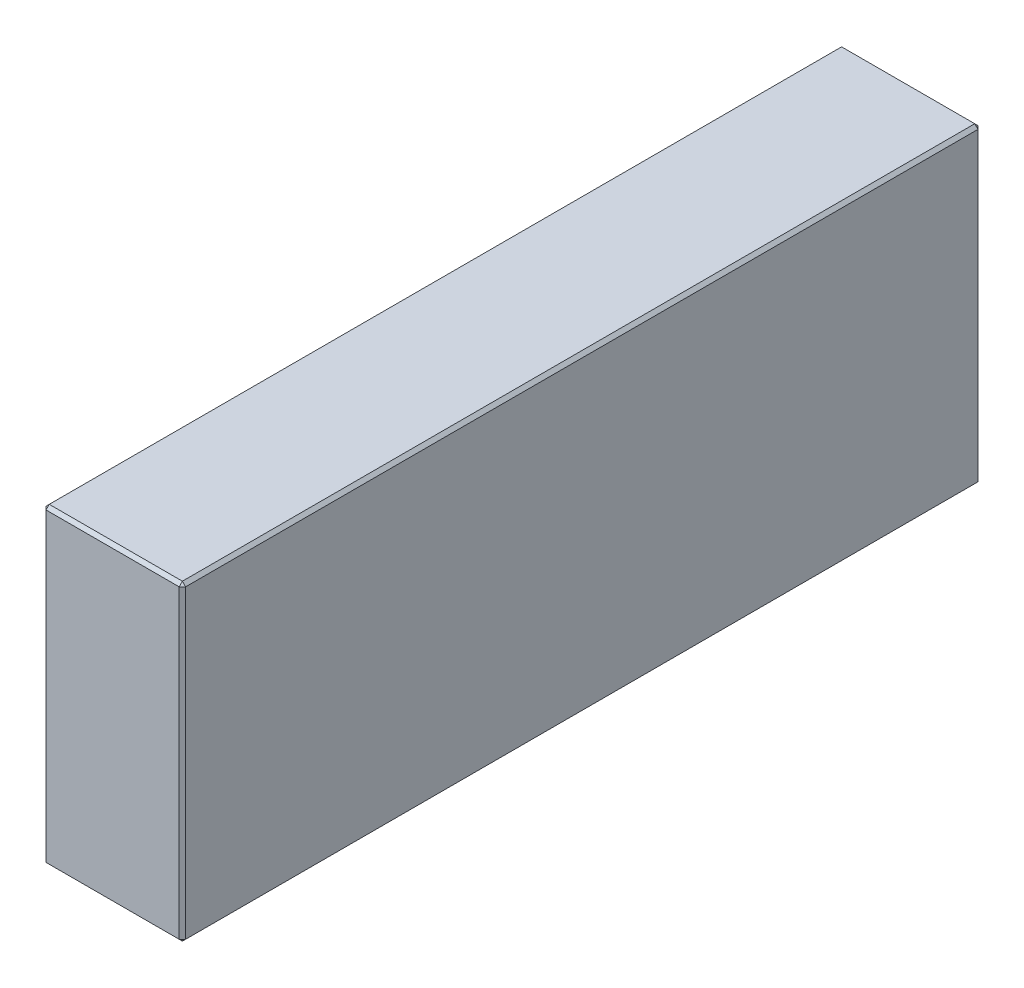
ISO-10303-21;
HEADER;
FILE_DESCRIPTION(('STEP AP214'),'2;1');
FILE_NAME('part.step','',(''),(''),'','','');
FILE_SCHEMA(('AUTOMOTIVE_DESIGN { 1 0 10303 214 1 1 1 1 }'));
ENDSEC;
DATA;
#1=APPLICATION_CONTEXT('core data for automotive mechanical design processes');
#2=APPLICATION_PROTOCOL_DEFINITION('international standard','automotive_design',2000,#1);
#3=PRODUCT_CONTEXT('',#1,'mechanical');
#4=PRODUCT('Part','Part','',(#3));
#5=PRODUCT_RELATED_PRODUCT_CATEGORY('part','',(#4));
#6=PRODUCT_DEFINITION_FORMATION('','',#4);
#7=PRODUCT_DEFINITION_CONTEXT('part definition',#1,'design');
#8=PRODUCT_DEFINITION('design','',#6,#7);
#9=PRODUCT_DEFINITION_SHAPE('','',#8);
#10=(LENGTH_UNIT() NAMED_UNIT(*) SI_UNIT(.MILLI.,.METRE.));
#11=(NAMED_UNIT(*) PLANE_ANGLE_UNIT() SI_UNIT($,.RADIAN.));
#12=(NAMED_UNIT(*) SI_UNIT($,.STERADIAN.) SOLID_ANGLE_UNIT());
#13=UNCERTAINTY_MEASURE_WITH_UNIT(LENGTH_MEASURE(1.E-05),#10,'distance_accuracy_value','');
#14=(GEOMETRIC_REPRESENTATION_CONTEXT(3) GLOBAL_UNCERTAINTY_ASSIGNED_CONTEXT((#13)) GLOBAL_UNIT_ASSIGNED_CONTEXT((#10,
#11,#12)) REPRESENTATION_CONTEXT('',''));
#15=CARTESIAN_POINT('',(0.,0.,0.));
#16=DIRECTION('',(0.,0.,1.));
#17=DIRECTION('',(1.,0.,0.));
#18=AXIS2_PLACEMENT_3D('',#15,#16,#17);
#19=CARTESIAN_POINT('',(-21.5,96.,123.));
#20=DIRECTION('',(1.,0.,0.));
#21=DIRECTION('',(0.,0.,-1.));
#22=AXIS2_PLACEMENT_3D('',#19,#20,#21);
#23=PLANE('',#22);
#24=DIRECTION('',(0.,-1.,0.));
#25=VECTOR('',#24,1.);
#26=CARTESIAN_POINT('',(-21.5,96.,-122.));
#27=LINE('',#26,#25);
#28=CARTESIAN_POINT('',(-21.5,95.,-122.));
#29=VERTEX_POINT('',#28);
#30=CARTESIAN_POINT('',(-21.5,1.,-122.));
#31=VERTEX_POINT('',#30);
#32=EDGE_CURVE('E114',#29,#31,#27,.T.);
#33=ORIENTED_EDGE('',*,*,#32,.T.);
#34=DIRECTION('',(0.,0.,1.));
#35=VECTOR('',#34,1.);
#36=CARTESIAN_POINT('',(-21.5,1.,123.));
#37=LINE('',#36,#35);
#38=CARTESIAN_POINT('',(-21.5,1.,122.));
#39=VERTEX_POINT('',#38);
#40=EDGE_CURVE('E110',#31,#39,#37,.T.);
#41=ORIENTED_EDGE('',*,*,#40,.T.);
#42=DIRECTION('',(0.,1.,0.));
#43=VECTOR('',#42,1.);
#44=CARTESIAN_POINT('',(-21.5,96.,122.));
#45=LINE('',#44,#43);
#46=CARTESIAN_POINT('',(-21.5,95.,122.));
#47=VERTEX_POINT('',#46);
#48=EDGE_CURVE('E103',#39,#47,#45,.T.);
#49=ORIENTED_EDGE('',*,*,#48,.T.);
#50=DIRECTION('',(0.,0.,-1.));
#51=VECTOR('',#50,1.);
#52=CARTESIAN_POINT('',(-21.5,95.,-123.));
#53=LINE('',#52,#51);
#54=EDGE_CURVE('E107',#47,#29,#53,.T.);
#55=ORIENTED_EDGE('',*,*,#54,.T.);
#56=EDGE_LOOP('',(#33,#41,#49,#55));
#57=FACE_BOUND('',#56,.T.);
#58=ADVANCED_FACE('F15',(#57),#23,.F.);
#59=CARTESIAN_POINT('',(21.5,96.,123.));
#60=DIRECTION('',(0.,0.,-1.));
#61=DIRECTION('',(-1.,0.,0.));
#62=AXIS2_PLACEMENT_3D('',#59,#60,#61);
#63=PLANE('',#62);
#64=DIRECTION('',(-1.,0.,0.));
#65=VECTOR('',#64,1.);
#66=CARTESIAN_POINT('',(-21.5,95.,123.));
#67=LINE('',#66,#65);
#68=CARTESIAN_POINT('',(20.5,95.,123.));
#69=VERTEX_POINT('',#68);
#70=CARTESIAN_POINT('',(-20.5,95.,123.));
#71=VERTEX_POINT('',#70);
#72=EDGE_CURVE('E164',#69,#71,#67,.T.);
#73=ORIENTED_EDGE('',*,*,#72,.T.);
#74=DIRECTION('',(0.,-1.,0.));
#75=VECTOR('',#74,1.);
#76=CARTESIAN_POINT('',(-20.5,96.,123.));
#77=LINE('',#76,#75);
#78=CARTESIAN_POINT('',(-20.5,1.,123.));
#79=VERTEX_POINT('',#78);
#80=EDGE_CURVE('E122',#71,#79,#77,.T.);
#81=ORIENTED_EDGE('',*,*,#80,.T.);
#82=DIRECTION('',(1.,0.,0.));
#83=VECTOR('',#82,1.);
#84=CARTESIAN_POINT('',(21.5,1.,123.));
#85=LINE('',#84,#83);
#86=CARTESIAN_POINT('',(20.5,1.,123.));
#87=VERTEX_POINT('',#86);
#88=EDGE_CURVE('E168',#79,#87,#85,.T.);
#89=ORIENTED_EDGE('',*,*,#88,.T.);
#90=DIRECTION('',(0.,1.,0.));
#91=VECTOR('',#90,1.);
#92=CARTESIAN_POINT('',(20.5,96.,123.));
#93=LINE('',#92,#91);
#94=EDGE_CURVE('E166',#87,#69,#93,.T.);
#95=ORIENTED_EDGE('',*,*,#94,.T.);
#96=EDGE_LOOP('',(#73,#81,#89,#95));
#97=FACE_BOUND('',#96,.T.);
#98=ADVANCED_FACE('F275',(#97),#63,.F.);
#99=CARTESIAN_POINT('',(21.5,96.,123.));
#100=DIRECTION('',(-1.,0.,0.));
#101=DIRECTION('',(0.,0.,1.));
#102=AXIS2_PLACEMENT_3D('',#99,#100,#101);
#103=PLANE('',#102);
#104=DIRECTION('',(0.,0.,-1.));
#105=VECTOR('',#104,1.);
#106=CARTESIAN_POINT('',(21.5,1.,123.));
#107=LINE('',#106,#105);
#108=CARTESIAN_POINT('',(21.5,1.,122.));
#109=VERTEX_POINT('',#108);
#110=CARTESIAN_POINT('',(21.5,1.,-122.));
#111=VERTEX_POINT('',#110);
#112=EDGE_CURVE('E159',#109,#111,#107,.T.);
#113=ORIENTED_EDGE('',*,*,#112,.T.);
#114=DIRECTION('',(0.,1.,0.));
#115=VECTOR('',#114,1.);
#116=CARTESIAN_POINT('',(21.5,96.,-122.));
#117=LINE('',#116,#115);
#118=CARTESIAN_POINT('',(21.5,95.,-122.));
#119=VERTEX_POINT('',#118);
#120=EDGE_CURVE('E161',#111,#119,#117,.T.);
#121=ORIENTED_EDGE('',*,*,#120,.T.);
#122=DIRECTION('',(0.,0.,1.));
#123=VECTOR('',#122,1.);
#124=CARTESIAN_POINT('',(21.5,95.,123.));
#125=LINE('',#124,#123);
#126=CARTESIAN_POINT('',(21.5,95.,122.));
#127=VERTEX_POINT('',#126);
#128=EDGE_CURVE('E155',#119,#127,#125,.T.);
#129=ORIENTED_EDGE('',*,*,#128,.T.);
#130=DIRECTION('',(0.,-1.,0.));
#131=VECTOR('',#130,1.);
#132=CARTESIAN_POINT('',(21.5,96.,122.));
#133=LINE('',#132,#131);
#134=EDGE_CURVE('E157',#127,#109,#133,.T.);
#135=ORIENTED_EDGE('',*,*,#134,.T.);
#136=EDGE_LOOP('',(#113,#121,#129,#135));
#137=FACE_BOUND('',#136,.T.);
#138=ADVANCED_FACE('F254',(#137),#103,.F.);
#139=CARTESIAN_POINT('',(21.5,96.,-123.));
#140=DIRECTION('',(0.,0.,1.));
#141=DIRECTION('',(1.,0.,0.));
#142=AXIS2_PLACEMENT_3D('',#139,#140,#141);
#143=PLANE('',#142);
#144=DIRECTION('',(0.,-1.,0.));
#145=VECTOR('',#144,1.);
#146=CARTESIAN_POINT('',(20.5,96.,-123.));
#147=LINE('',#146,#145);
#148=CARTESIAN_POINT('',(20.5,95.,-123.));
#149=VERTEX_POINT('',#148);
#150=CARTESIAN_POINT('',(20.5,1.,-123.));
#151=VERTEX_POINT('',#150);
#152=EDGE_CURVE('E148',#149,#151,#147,.T.);
#153=ORIENTED_EDGE('',*,*,#152,.T.);
#154=DIRECTION('',(-1.,0.,0.));
#155=VECTOR('',#154,1.);
#156=CARTESIAN_POINT('',(21.5,1.,-123.));
#157=LINE('',#156,#155);
#158=CARTESIAN_POINT('',(-20.5,1.,-123.));
#159=VERTEX_POINT('',#158);
#160=EDGE_CURVE('E153',#151,#159,#157,.T.);
#161=ORIENTED_EDGE('',*,*,#160,.T.);
#162=DIRECTION('',(0.,1.,0.));
#163=VECTOR('',#162,1.);
#164=CARTESIAN_POINT('',(-20.5,96.,-123.));
#165=LINE('',#164,#163);
#166=CARTESIAN_POINT('',(-20.5,95.,-123.));
#167=VERTEX_POINT('',#166);
#168=EDGE_CURVE('E150',#159,#167,#165,.T.);
#169=ORIENTED_EDGE('',*,*,#168,.T.);
#170=DIRECTION('',(1.,0.,0.));
#171=VECTOR('',#170,1.);
#172=CARTESIAN_POINT('',(21.5,95.,-123.));
#173=LINE('',#172,#171);
#174=EDGE_CURVE('E146',#167,#149,#173,.T.);
#175=ORIENTED_EDGE('',*,*,#174,.T.);
#176=EDGE_LOOP('',(#153,#161,#169,#175));
#177=FACE_BOUND('',#176,.T.);
#178=ADVANCED_FACE('F284',(#177),#143,.F.);
#179=CARTESIAN_POINT('',(0.,96.,0.));
#180=DIRECTION('',(0.,1.,0.));
#181=DIRECTION('',(0.,0.,1.));
#182=AXIS2_PLACEMENT_3D('',#179,#180,#181);
#183=PLANE('',#182);
#184=DIRECTION('',(0.,0.,-1.));
#185=VECTOR('',#184,1.);
#186=CARTESIAN_POINT('',(20.5,96.,-123.));
#187=LINE('',#186,#185);
#188=CARTESIAN_POINT('',(20.5,96.,122.));
#189=VERTEX_POINT('',#188);
#190=CARTESIAN_POINT('',(20.5,96.,-122.));
#191=VERTEX_POINT('',#190);
#192=EDGE_CURVE('E24',#189,#191,#187,.T.);
#193=ORIENTED_EDGE('',*,*,#192,.T.);
#194=DIRECTION('',(-1.,0.,0.));
#195=VECTOR('',#194,1.);
#196=CARTESIAN_POINT('',(-21.5,96.,-122.));
#197=LINE('',#196,#195);
#198=CARTESIAN_POINT('',(-20.5,96.,-122.));
#199=VERTEX_POINT('',#198);
#200=EDGE_CURVE('E9',#191,#199,#197,.T.);
#201=ORIENTED_EDGE('',*,*,#200,.T.);
#202=DIRECTION('',(0.,0.,1.));
#203=VECTOR('',#202,1.);
#204=CARTESIAN_POINT('',(-20.5,96.,123.));
#205=LINE('',#204,#203);
#206=CARTESIAN_POINT('',(-20.5,96.,122.));
#207=VERTEX_POINT('',#206);
#208=EDGE_CURVE('E180',#199,#207,#205,.T.);
#209=ORIENTED_EDGE('',*,*,#208,.T.);
#210=DIRECTION('',(1.,0.,0.));
#211=VECTOR('',#210,1.);
#212=CARTESIAN_POINT('',(21.5,96.,122.));
#213=LINE('',#212,#211);
#214=EDGE_CURVE('E35',#207,#189,#213,.T.);
#215=ORIENTED_EDGE('',*,*,#214,.T.);
#216=EDGE_LOOP('',(#193,#201,#209,#215));
#217=FACE_BOUND('',#216,.T.);
#218=ADVANCED_FACE('F350',(#217),#183,.T.);
#219=CARTESIAN_POINT('',(0.,0.,0.));
#220=DIRECTION('',(0.,1.,0.));
#221=DIRECTION('',(0.,0.,1.));
#222=AXIS2_PLACEMENT_3D('',#219,#220,#221);
#223=PLANE('',#222);
#224=DIRECTION('',(0.,0.,1.));
#225=VECTOR('',#224,1.);
#226=CARTESIAN_POINT('',(20.5,0.,0.));
#227=LINE('',#226,#225);
#228=CARTESIAN_POINT('',(20.5,0.,-122.));
#229=VERTEX_POINT('',#228);
#230=CARTESIAN_POINT('',(20.5,0.,122.));
#231=VERTEX_POINT('',#230);
#232=EDGE_CURVE('E171',#229,#231,#227,.T.);
#233=ORIENTED_EDGE('',*,*,#232,.T.);
#234=DIRECTION('',(-1.,0.,0.));
#235=VECTOR('',#234,1.);
#236=CARTESIAN_POINT('',(0.,0.,122.));
#237=LINE('',#236,#235);
#238=CARTESIAN_POINT('',(-20.5,0.,122.));
#239=VERTEX_POINT('',#238);
#240=EDGE_CURVE('E177',#231,#239,#237,.T.);
#241=ORIENTED_EDGE('',*,*,#240,.T.);
#242=DIRECTION('',(0.,0.,-1.));
#243=VECTOR('',#242,1.);
#244=CARTESIAN_POINT('',(-20.5,0.,0.));
#245=LINE('',#244,#243);
#246=CARTESIAN_POINT('',(-20.5,0.,-122.));
#247=VERTEX_POINT('',#246);
#248=EDGE_CURVE('E175',#239,#247,#245,.T.);
#249=ORIENTED_EDGE('',*,*,#248,.T.);
#250=DIRECTION('',(1.,0.,0.));
#251=VECTOR('',#250,1.);
#252=CARTESIAN_POINT('',(0.,0.,-122.));
#253=LINE('',#252,#251);
#254=EDGE_CURVE('E173',#247,#229,#253,.T.);
#255=ORIENTED_EDGE('',*,*,#254,.T.);
#256=EDGE_LOOP('',(#233,#241,#249,#255));
#257=FACE_BOUND('',#256,.T.);
#258=ADVANCED_FACE('F246',(#257),#223,.F.);
#259=CARTESIAN_POINT('',(21.5,96.,122.));
#260=DIRECTION('',(-0.707106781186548,0.,-0.707106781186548));
#261=DIRECTION('',(0.,-1.,0.));
#262=AXIS2_PLACEMENT_3D('',#259,#260,#261);
#263=PLANE('',#262);
#264=DIRECTION('',(-0.707106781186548,0.,0.707106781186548));
#265=VECTOR('',#264,1.);
#266=CARTESIAN_POINT('',(20.5,95.,123.));
#267=LINE('',#266,#265);
#268=EDGE_CURVE('E19',#69,#127,#267,.F.);
#269=ORIENTED_EDGE('',*,*,#268,.F.);
#270=ORIENTED_EDGE('',*,*,#94,.F.);
#271=DIRECTION('',(0.707106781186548,0.,-0.707106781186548));
#272=VECTOR('',#271,1.);
#273=CARTESIAN_POINT('',(20.5,1.,123.));
#274=LINE('',#273,#272);
#275=EDGE_CURVE('E142',#109,#87,#274,.F.);
#276=ORIENTED_EDGE('',*,*,#275,.F.);
#277=ORIENTED_EDGE('',*,*,#134,.F.);
#278=EDGE_LOOP('',(#269,#270,#276,#277));
#279=FACE_BOUND('',#278,.T.);
#280=ADVANCED_FACE('F17',(#279),#263,.F.);
#281=CARTESIAN_POINT('',(20.5,95.,123.));
#282=DIRECTION('',(0.577350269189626,0.577350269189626,0.577350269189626));
#283=DIRECTION('',(0.707106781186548,0.,-0.707106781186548));
#284=AXIS2_PLACEMENT_3D('',#281,#282,#283);
#285=PLANE('',#284);
#286=DIRECTION('',(0.,-0.707106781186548,0.707106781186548));
#287=VECTOR('',#286,1.);
#288=CARTESIAN_POINT('',(20.5,95.,123.));
#289=LINE('',#288,#287);
#290=EDGE_CURVE('E226',#69,#189,#289,.F.);
#291=ORIENTED_EDGE('',*,*,#290,.F.);
#292=ORIENTED_EDGE('',*,*,#268,.T.);
#293=DIRECTION('',(-0.707106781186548,0.707106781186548,0.));
#294=VECTOR('',#293,1.);
#295=CARTESIAN_POINT('',(21.,95.5,122.));
#296=LINE('',#295,#294);
#297=EDGE_CURVE('E228',#189,#127,#296,.F.);
#298=ORIENTED_EDGE('',*,*,#297,.F.);
#299=EDGE_LOOP('',(#291,#292,#298));
#300=FACE_BOUND('',#299,.T.);
#301=ADVANCED_FACE('F270',(#300),#285,.T.);
#302=CARTESIAN_POINT('',(20.5,1.,123.));
#303=DIRECTION('',(0.577350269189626,-0.577350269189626,0.577350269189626));
#304=DIRECTION('',(0.707106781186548,0.,-0.707106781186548));
#305=AXIS2_PLACEMENT_3D('',#302,#303,#304);
#306=PLANE('',#305);
#307=DIRECTION('',(-0.707106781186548,-0.707106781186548,0.));
#308=VECTOR('',#307,1.);
#309=CARTESIAN_POINT('',(21.,0.5,122.));
#310=LINE('',#309,#308);
#311=EDGE_CURVE('E220',#109,#231,#310,.T.);
#312=ORIENTED_EDGE('',*,*,#311,.F.);
#313=ORIENTED_EDGE('',*,*,#275,.T.);
#314=DIRECTION('',(0.,0.707106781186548,0.707106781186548));
#315=VECTOR('',#314,1.);
#316=CARTESIAN_POINT('',(20.5,1.,123.));
#317=LINE('',#316,#315);
#318=EDGE_CURVE('E223',#231,#87,#317,.T.);
#319=ORIENTED_EDGE('',*,*,#318,.F.);
#320=EDGE_LOOP('',(#312,#313,#319));
#321=FACE_BOUND('',#320,.T.);
#322=ADVANCED_FACE('F235',(#321),#306,.T.);
#323=CARTESIAN_POINT('',(20.5,96.,0.));
#324=DIRECTION('',(0.707106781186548,0.707106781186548,0.));
#325=DIRECTION('',(0.,0.,1.));
#326=AXIS2_PLACEMENT_3D('',#323,#324,#325);
#327=PLANE('',#326);
#328=ORIENTED_EDGE('',*,*,#297,.T.);
#329=ORIENTED_EDGE('',*,*,#128,.F.);
#330=DIRECTION('',(0.707106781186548,-0.707106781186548,0.));
#331=VECTOR('',#330,1.);
#332=CARTESIAN_POINT('',(21.5,95.,-122.));
#333=LINE('',#332,#331);
#334=EDGE_CURVE('E215',#191,#119,#333,.T.);
#335=ORIENTED_EDGE('',*,*,#334,.F.);
#336=ORIENTED_EDGE('',*,*,#192,.F.);
#337=EDGE_LOOP('',(#328,#329,#335,#336));
#338=FACE_BOUND('',#337,.T.);
#339=ADVANCED_FACE('F265',(#338),#327,.T.);
#340=CARTESIAN_POINT('',(0.,96.,122.));
#341=DIRECTION('',(0.,0.707106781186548,0.707106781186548));
#342=DIRECTION('',(-1.,0.,0.));
#343=AXIS2_PLACEMENT_3D('',#340,#341,#342);
#344=PLANE('',#343);
#345=ORIENTED_EDGE('',*,*,#290,.T.);
#346=ORIENTED_EDGE('',*,*,#214,.F.);
#347=DIRECTION('',(0.,0.707106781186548,-0.707106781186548));
#348=VECTOR('',#347,1.);
#349=CARTESIAN_POINT('',(-20.5,95.5,122.5));
#350=LINE('',#349,#348);
#351=EDGE_CURVE('E126',#71,#207,#350,.T.);
#352=ORIENTED_EDGE('',*,*,#351,.F.);
#353=ORIENTED_EDGE('',*,*,#72,.F.);
#354=EDGE_LOOP('',(#345,#346,#352,#353));
#355=FACE_BOUND('',#354,.T.);
#356=ADVANCED_FACE('F273',(#355),#344,.T.);
#357=CARTESIAN_POINT('',(-20.5,96.,123.));
#358=DIRECTION('',(0.707106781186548,0.,-0.707106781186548));
#359=DIRECTION('',(0.,-1.,0.));
#360=AXIS2_PLACEMENT_3D('',#357,#358,#359);
#361=PLANE('',#360);
#362=DIRECTION('',(0.707106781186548,0.,0.707106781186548));
#363=VECTOR('',#362,1.);
#364=CARTESIAN_POINT('',(-20.5,1.,123.));
#365=LINE('',#364,#363);
#366=EDGE_CURVE('E127',#79,#39,#365,.F.);
#367=ORIENTED_EDGE('',*,*,#366,.F.);
#368=ORIENTED_EDGE('',*,*,#80,.F.);
#369=DIRECTION('',(-0.707106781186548,0.,-0.707106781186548));
#370=VECTOR('',#369,1.);
#371=CARTESIAN_POINT('',(-21.5,95.,122.));
#372=LINE('',#371,#370);
#373=EDGE_CURVE('E118',#47,#71,#372,.F.);
#374=ORIENTED_EDGE('',*,*,#373,.F.);
#375=ORIENTED_EDGE('',*,*,#48,.F.);
#376=EDGE_LOOP('',(#367,#368,#374,#375));
#377=FACE_BOUND('',#376,.T.);
#378=ADVANCED_FACE('F120',(#377),#361,.F.);
#379=CARTESIAN_POINT('',(21.5,1.,123.));
#380=DIRECTION('',(0.,0.707106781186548,-0.707106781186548));
#381=DIRECTION('',(1.,0.,0.));
#382=AXIS2_PLACEMENT_3D('',#379,#380,#381);
#383=PLANE('',#382);
#384=ORIENTED_EDGE('',*,*,#318,.T.);
#385=ORIENTED_EDGE('',*,*,#88,.F.);
#386=DIRECTION('',(0.,-0.707106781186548,-0.707106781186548));
#387=VECTOR('',#386,1.);
#388=CARTESIAN_POINT('',(-20.5,1.,123.));
#389=LINE('',#388,#387);
#390=EDGE_CURVE('E211',#239,#79,#389,.F.);
#391=ORIENTED_EDGE('',*,*,#390,.F.);
#392=ORIENTED_EDGE('',*,*,#240,.F.);
#393=EDGE_LOOP('',(#384,#385,#391,#392));
#394=FACE_BOUND('',#393,.T.);
#395=ADVANCED_FACE('F243',(#394),#383,.F.);
#396=CARTESIAN_POINT('',(21.5,1.,123.));
#397=DIRECTION('',(-0.707106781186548,0.707106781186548,0.));
#398=DIRECTION('',(0.,0.,-1.));
#399=AXIS2_PLACEMENT_3D('',#396,#397,#398);
#400=PLANE('',#399);
#401=ORIENTED_EDGE('',*,*,#311,.T.);
#402=ORIENTED_EDGE('',*,*,#232,.F.);
#403=DIRECTION('',(0.707106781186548,0.707106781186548,0.));
#404=VECTOR('',#403,1.);
#405=CARTESIAN_POINT('',(21.,0.5,-122.));
#406=LINE('',#405,#404);
#407=EDGE_CURVE('E208',#111,#229,#406,.F.);
#408=ORIENTED_EDGE('',*,*,#407,.F.);
#409=ORIENTED_EDGE('',*,*,#112,.F.);
#410=EDGE_LOOP('',(#401,#402,#408,#409));
#411=FACE_BOUND('',#410,.T.);
#412=ADVANCED_FACE('F251',(#411),#400,.F.);
#413=CARTESIAN_POINT('',(20.5,96.,-123.));
#414=DIRECTION('',(-0.707106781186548,0.,0.707106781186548));
#415=DIRECTION('',(0.,-1.,0.));
#416=AXIS2_PLACEMENT_3D('',#413,#414,#415);
#417=PLANE('',#416);
#418=DIRECTION('',(0.707106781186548,0.,0.707106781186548));
#419=VECTOR('',#418,1.);
#420=CARTESIAN_POINT('',(21.5,95.,-122.));
#421=LINE('',#420,#419);
#422=EDGE_CURVE('E217',#119,#149,#421,.F.);
#423=ORIENTED_EDGE('',*,*,#422,.F.);
#424=ORIENTED_EDGE('',*,*,#120,.F.);
#425=DIRECTION('',(-0.707106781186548,0.,-0.707106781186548));
#426=VECTOR('',#425,1.);
#427=CARTESIAN_POINT('',(20.5,1.,-123.));
#428=LINE('',#427,#426);
#429=EDGE_CURVE('E205',#151,#111,#428,.F.);
#430=ORIENTED_EDGE('',*,*,#429,.F.);
#431=ORIENTED_EDGE('',*,*,#152,.F.);
#432=EDGE_LOOP('',(#423,#424,#430,#431));
#433=FACE_BOUND('',#432,.T.);
#434=ADVANCED_FACE('F258',(#433),#417,.F.);
#435=CARTESIAN_POINT('',(21.5,95.,-122.));
#436=DIRECTION('',(0.577350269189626,0.577350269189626,-0.577350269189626));
#437=DIRECTION('',(-0.707106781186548,0.,-0.707106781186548));
#438=AXIS2_PLACEMENT_3D('',#435,#436,#437);
#439=PLANE('',#438);
#440=ORIENTED_EDGE('',*,*,#334,.T.);
#441=ORIENTED_EDGE('',*,*,#422,.T.);
#442=DIRECTION('',(0.,0.707106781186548,0.707106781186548));
#443=VECTOR('',#442,1.);
#444=CARTESIAN_POINT('',(20.5,95.5,-122.5));
#445=LINE('',#444,#443);
#446=EDGE_CURVE('E134',#191,#149,#445,.F.);
#447=ORIENTED_EDGE('',*,*,#446,.F.);
#448=EDGE_LOOP('',(#440,#441,#447));
#449=FACE_BOUND('',#448,.T.);
#450=ADVANCED_FACE('F325',(#449),#439,.T.);
#451=CARTESIAN_POINT('',(-21.5,95.,122.));
#452=DIRECTION('',(-0.577350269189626,0.577350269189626,0.577350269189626));
#453=DIRECTION('',(0.707106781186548,0.,0.707106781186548));
#454=AXIS2_PLACEMENT_3D('',#451,#452,#453);
#455=PLANE('',#454);
#456=ORIENTED_EDGE('',*,*,#373,.T.);
#457=ORIENTED_EDGE('',*,*,#351,.T.);
#458=DIRECTION('',(-0.707106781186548,-0.707106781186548,0.));
#459=VECTOR('',#458,1.);
#460=CARTESIAN_POINT('',(-21.5,95.,122.));
#461=LINE('',#460,#459);
#462=EDGE_CURVE('E130',#47,#207,#461,.F.);
#463=ORIENTED_EDGE('',*,*,#462,.F.);
#464=EDGE_LOOP('',(#456,#457,#463));
#465=FACE_BOUND('',#464,.T.);
#466=ADVANCED_FACE('F131',(#465),#455,.T.);
#467=CARTESIAN_POINT('',(-20.5,1.,123.));
#468=DIRECTION('',(-0.577350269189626,-0.577350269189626,0.577350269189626));
#469=DIRECTION('',(0.707106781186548,0.,0.707106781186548));
#470=AXIS2_PLACEMENT_3D('',#467,#468,#469);
#471=PLANE('',#470);
#472=ORIENTED_EDGE('',*,*,#390,.T.);
#473=ORIENTED_EDGE('',*,*,#366,.T.);
#474=DIRECTION('',(-0.707106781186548,0.707106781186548,0.));
#475=VECTOR('',#474,1.);
#476=CARTESIAN_POINT('',(-21.,0.5,122.));
#477=LINE('',#476,#475);
#478=EDGE_CURVE('E135',#239,#39,#477,.T.);
#479=ORIENTED_EDGE('',*,*,#478,.F.);
#480=EDGE_LOOP('',(#472,#473,#479));
#481=FACE_BOUND('',#480,.T.);
#482=ADVANCED_FACE('F318',(#481),#471,.T.);
#483=CARTESIAN_POINT('',(20.5,1.,-123.));
#484=DIRECTION('',(0.577350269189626,-0.577350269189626,-0.577350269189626));
#485=DIRECTION('',(-0.707106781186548,0.,-0.707106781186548));
#486=AXIS2_PLACEMENT_3D('',#483,#484,#485);
#487=PLANE('',#486);
#488=ORIENTED_EDGE('',*,*,#429,.T.);
#489=ORIENTED_EDGE('',*,*,#407,.T.);
#490=DIRECTION('',(0.,-0.707106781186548,0.707106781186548));
#491=VECTOR('',#490,1.);
#492=CARTESIAN_POINT('',(20.5,1.,-123.));
#493=LINE('',#492,#491);
#494=EDGE_CURVE('E198',#151,#229,#493,.T.);
#495=ORIENTED_EDGE('',*,*,#494,.F.);
#496=EDGE_LOOP('',(#488,#489,#495));
#497=FACE_BOUND('',#496,.T.);
#498=ADVANCED_FACE('F314',(#497),#487,.T.);
#499=CARTESIAN_POINT('',(0.,96.,-122.));
#500=DIRECTION('',(0.,0.707106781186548,-0.707106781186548));
#501=DIRECTION('',(1.,0.,0.));
#502=AXIS2_PLACEMENT_3D('',#499,#500,#501);
#503=PLANE('',#502);
#504=ORIENTED_EDGE('',*,*,#446,.T.);
#505=ORIENTED_EDGE('',*,*,#174,.F.);
#506=DIRECTION('',(0.,-0.707106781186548,-0.707106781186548));
#507=VECTOR('',#506,1.);
#508=CARTESIAN_POINT('',(-20.5,95.,-123.));
#509=LINE('',#508,#507);
#510=EDGE_CURVE('E195',#199,#167,#509,.T.);
#511=ORIENTED_EDGE('',*,*,#510,.F.);
#512=ORIENTED_EDGE('',*,*,#200,.F.);
#513=EDGE_LOOP('',(#504,#505,#511,#512));
#514=FACE_BOUND('',#513,.T.);
#515=ADVANCED_FACE('F311',(#514),#503,.T.);
#516=CARTESIAN_POINT('',(-20.5,96.,0.));
#517=DIRECTION('',(-0.707106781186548,0.707106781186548,0.));
#518=DIRECTION('',(0.,0.,-1.));
#519=AXIS2_PLACEMENT_3D('',#516,#517,#518);
#520=PLANE('',#519);
#521=ORIENTED_EDGE('',*,*,#462,.T.);
#522=ORIENTED_EDGE('',*,*,#208,.F.);
#523=DIRECTION('',(0.707106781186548,0.707106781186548,0.));
#524=VECTOR('',#523,1.);
#525=CARTESIAN_POINT('',(-21.,95.5,-122.));
#526=LINE('',#525,#524);
#527=EDGE_CURVE('E138',#29,#199,#526,.T.);
#528=ORIENTED_EDGE('',*,*,#527,.F.);
#529=ORIENTED_EDGE('',*,*,#54,.F.);
#530=EDGE_LOOP('',(#521,#522,#528,#529));
#531=FACE_BOUND('',#530,.T.);
#532=ADVANCED_FACE('F137',(#531),#520,.T.);
#533=CARTESIAN_POINT('',(-21.5,1.,123.));
#534=DIRECTION('',(0.707106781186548,0.707106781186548,0.));
#535=DIRECTION('',(0.,0.,1.));
#536=AXIS2_PLACEMENT_3D('',#533,#534,#535);
#537=PLANE('',#536);
#538=ORIENTED_EDGE('',*,*,#478,.T.);
#539=ORIENTED_EDGE('',*,*,#40,.F.);
#540=DIRECTION('',(0.707106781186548,-0.707106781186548,0.));
#541=VECTOR('',#540,1.);
#542=CARTESIAN_POINT('',(-21.5,1.,-122.));
#543=LINE('',#542,#541);
#544=EDGE_CURVE('E191',#247,#31,#543,.F.);
#545=ORIENTED_EDGE('',*,*,#544,.F.);
#546=ORIENTED_EDGE('',*,*,#248,.F.);
#547=EDGE_LOOP('',(#538,#539,#545,#546));
#548=FACE_BOUND('',#547,.T.);
#549=ADVANCED_FACE('F304',(#548),#537,.F.);
#550=CARTESIAN_POINT('',(21.5,1.,-123.));
#551=DIRECTION('',(0.,0.707106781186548,0.707106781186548));
#552=DIRECTION('',(-1.,0.,0.));
#553=AXIS2_PLACEMENT_3D('',#550,#551,#552);
#554=PLANE('',#553);
#555=ORIENTED_EDGE('',*,*,#494,.T.);
#556=ORIENTED_EDGE('',*,*,#254,.F.);
#557=DIRECTION('',(0.,0.707106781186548,-0.707106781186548));
#558=VECTOR('',#557,1.);
#559=CARTESIAN_POINT('',(-20.5,0.5,-122.5));
#560=LINE('',#559,#558);
#561=EDGE_CURVE('E188',#159,#247,#560,.F.);
#562=ORIENTED_EDGE('',*,*,#561,.F.);
#563=ORIENTED_EDGE('',*,*,#160,.F.);
#564=EDGE_LOOP('',(#555,#556,#562,#563));
#565=FACE_BOUND('',#564,.T.);
#566=ADVANCED_FACE('F300',(#565),#554,.F.);
#567=CARTESIAN_POINT('',(-20.5,95.,-123.));
#568=DIRECTION('',(-0.577350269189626,0.577350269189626,-0.577350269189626));
#569=DIRECTION('',(-0.707106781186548,0.,0.707106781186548));
#570=AXIS2_PLACEMENT_3D('',#567,#568,#569);
#571=PLANE('',#570);
#572=ORIENTED_EDGE('',*,*,#527,.T.);
#573=ORIENTED_EDGE('',*,*,#510,.T.);
#574=DIRECTION('',(0.707106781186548,0.,-0.707106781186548));
#575=VECTOR('',#574,1.);
#576=CARTESIAN_POINT('',(-20.5,95.,-123.));
#577=LINE('',#576,#575);
#578=EDGE_CURVE('E186',#29,#167,#577,.T.);
#579=ORIENTED_EDGE('',*,*,#578,.F.);
#580=EDGE_LOOP('',(#572,#573,#579));
#581=FACE_BOUND('',#580,.T.);
#582=ADVANCED_FACE('F296',(#581),#571,.T.);
#583=CARTESIAN_POINT('',(-21.5,1.,-122.));
#584=DIRECTION('',(-0.577350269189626,-0.577350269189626,-0.577350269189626));
#585=DIRECTION('',(-0.707106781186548,0.,0.707106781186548));
#586=AXIS2_PLACEMENT_3D('',#583,#584,#585);
#587=PLANE('',#586);
#588=ORIENTED_EDGE('',*,*,#561,.T.);
#589=ORIENTED_EDGE('',*,*,#544,.T.);
#590=DIRECTION('',(-0.707106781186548,0.,0.707106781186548));
#591=VECTOR('',#590,1.);
#592=CARTESIAN_POINT('',(-21.5,1.,-122.));
#593=LINE('',#592,#591);
#594=EDGE_CURVE('E184',#159,#31,#593,.T.);
#595=ORIENTED_EDGE('',*,*,#594,.F.);
#596=EDGE_LOOP('',(#588,#589,#595));
#597=FACE_BOUND('',#596,.T.);
#598=ADVANCED_FACE('F292',(#597),#587,.T.);
#599=CARTESIAN_POINT('',(-21.5,96.,-122.));
#600=DIRECTION('',(0.707106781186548,0.,0.707106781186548));
#601=DIRECTION('',(0.,-1.,0.));
#602=AXIS2_PLACEMENT_3D('',#599,#600,#601);
#603=PLANE('',#602);
#604=ORIENTED_EDGE('',*,*,#578,.T.);
#605=ORIENTED_EDGE('',*,*,#168,.F.);
#606=ORIENTED_EDGE('',*,*,#594,.T.);
#607=ORIENTED_EDGE('',*,*,#32,.F.);
#608=EDGE_LOOP('',(#604,#605,#606,#607));
#609=FACE_BOUND('',#608,.T.);
#610=ADVANCED_FACE('F289',(#609),#603,.F.);
#611=CLOSED_SHELL('',(#58,#98,#138,#178,#218,#258,#280,#301,#322,#339,#356,#378,#395,#412,#434,
#450,#466,#482,#498,#515,#532,#549,#566,#582,#598,#610));
#612=MANIFOLD_SOLID_BREP('B1',#611);
#613=ADVANCED_BREP_SHAPE_REPRESENTATION('',(#18,#612),#14);
#614=SHAPE_DEFINITION_REPRESENTATION(#9,#613);
ENDSEC;
END-ISO-10303-21;
